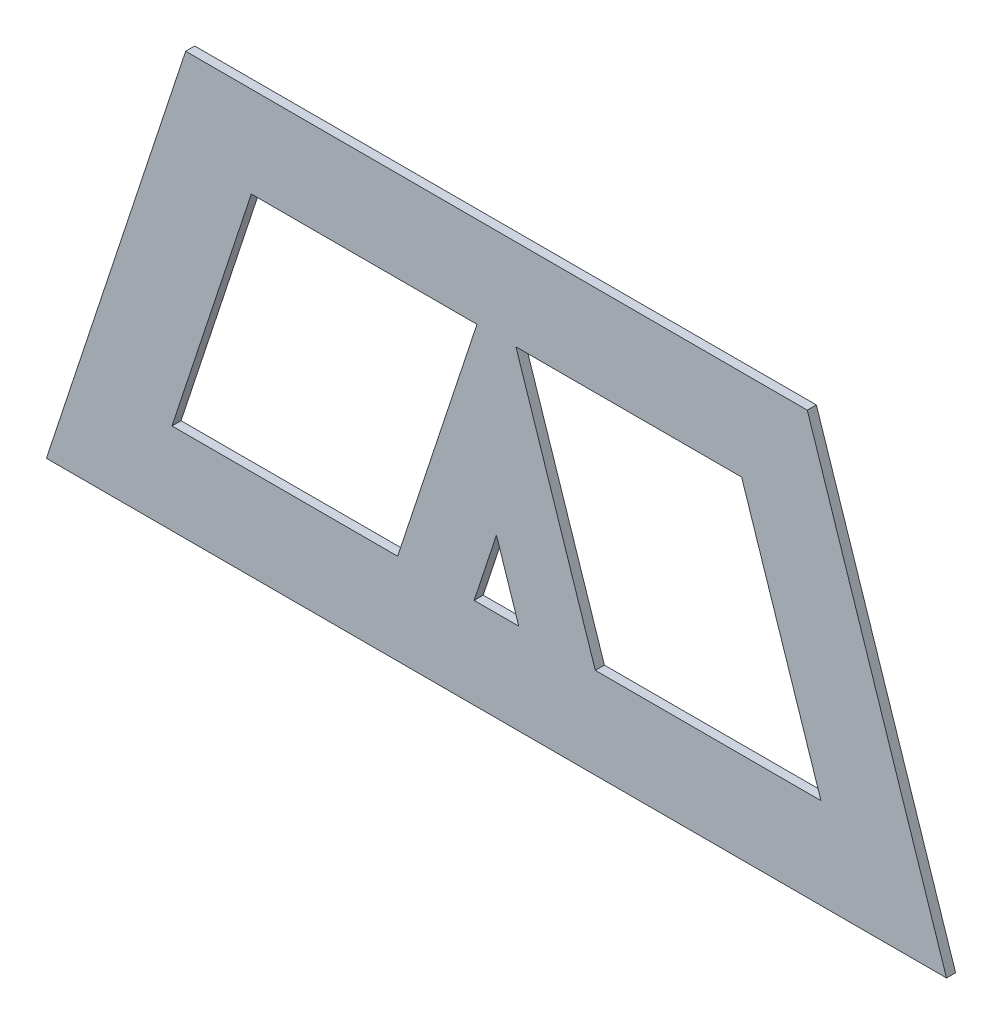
from build123d import *

# Parameters (mm, degrees)
BOSS_EXTRUDE1_DEPTH = 6.35


with BuildPart() as part:
    # Model → Boss-Extrude1 (new body)
    with BuildSketch(Plane.XY):
        Polygon((-353.589442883, 317.269702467), (-256.21626799, 612.477004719), (178.483635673, 612.477004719), (275.856810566, 317.269702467), align=None)
        Polygon((132.563710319, 548.977004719), (-25.238150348, 548.977004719), (30.244484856, 380.769702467), (188.046345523, 380.769702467), align=None, mode=Mode.SUBTRACT)
        Polygon((-265.778977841, 380.769702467), (-210.296342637, 548.977004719), (-52.494481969, 548.977004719), (-107.977117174, 380.769702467), align=None, mode=Mode.SUBTRACT)
        Polygon((-54.484961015, 380.769702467), (-38.866316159, 428.120916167), (-23.247671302, 380.769702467), align=None, mode=Mode.SUBTRACT)
    extrude(amount=BOSS_EXTRUDE1_DEPTH)


solid = part.part
